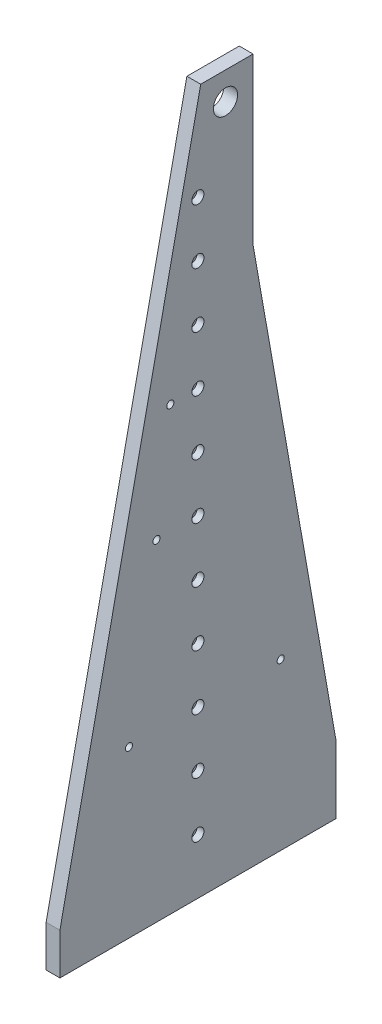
from build123d import *

# Parameters (mm, degrees)
BOSS_EXTRUDE1_DEPTH                              = 12.7
F_7_8_0_875_DIAMETER_HOLE1_D                     = 22.225
F_1_4_CLEARANCE_HOLE1_D                          = 6.5278
F_1_4_CLEARANCE_HOLE1_DEPTH                      = 22.86
F_1_4_CLEARANCE_HOLE1_TIP                        = 1.961148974
F_1_4_20_TAPPED_HOLE1_D                          = 5.1054
F_1_4_20_TAPPED_HOLE1_DEPTH                      = 13.335
F_1_4_20_TAPPED_HOLE1_TIP                        = 1.533816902
CBORE_FOR_1_4_SOCKET_HEAD_CAP_SCREW1_D           = 6.5278
CBORE_FOR_1_4_SOCKET_HEAD_CAP_SCREW1_CBORE_D     = 11.1125
CBORE_FOR_1_4_SOCKET_HEAD_CAP_SCREW1_CBORE_DEPTH = 6.35
LPATTERN1_COUNT                                  = 11
LPATTERN1_PITCH                                  = 50.8
FILLET1_R                                        = 9.652


with BuildPart() as part:
    # Sketch1 → Boss-Extrude1 (new body)
    with BuildSketch(Plane(origin=(0, 0, 0), x_dir=(0, 0, -1), z_dir=(1, 0, 0))):
        Polygon((2.574479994, 647.7), (50.8, 647.7), (50.8, 495.3), (127, 63.148325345), (127, 0), (-127, 0), (-127, 38.1), align=None)
    extrude(amount=BOSS_EXTRUDE1_DEPTH)

    # 7_8 _0.875_ Diameter Hole1 (through all)
    with Locations(Plane(origin=(12.7, 0, 0), x_dir=(0, 0, -1), z_dir=(1, 0, 0))):
        with Locations((25.4, 622.3)):
            Hole(F_7_8_0_875_DIAMETER_HOLE1_D / 2)

    # 1_4 Clearance Hole1
    with Locations(Plane(origin=(12.7, 0, 0), x_dir=(0, 0, -1), z_dir=(1, 0, 0))):
        with Locations((-25.4, 406.4), (-38.1, 304.8), (-63.5, 152.4), (76.2, 152.4)):
            Hole(F_1_4_CLEARANCE_HOLE1_D / 2, depth=F_1_4_CLEARANCE_HOLE1_DEPTH)
            with Locations((0, 0, -(F_1_4_CLEARANCE_HOLE1_DEPTH + F_1_4_CLEARANCE_HOLE1_TIP / 2))):  # 118° drill point
                Cone(0, F_1_4_CLEARANCE_HOLE1_D / 2, F_1_4_CLEARANCE_HOLE1_TIP, mode=Mode.SUBTRACT)

    # 1_4-20 Tapped Hole1
    with Locations(Plane(origin=(0, 0, 0), x_dir=(-1, 0, 0), z_dir=(0, -1, 0))):
        with Locations((-6.35, 101.6), (-6.35, 50.8), (-6.35, 0), (-6.35, -50.8), (-6.35, -101.6)):
            Hole(F_1_4_20_TAPPED_HOLE1_D / 2, depth=F_1_4_20_TAPPED_HOLE1_DEPTH)
            with Locations((0, 0, -(F_1_4_20_TAPPED_HOLE1_DEPTH + F_1_4_20_TAPPED_HOLE1_TIP / 2))):  # 118° drill point
                Cone(0, F_1_4_20_TAPPED_HOLE1_D / 2, F_1_4_20_TAPPED_HOLE1_TIP, mode=Mode.SUBTRACT)

    # CBORE for 1_4 Socket Head Cap Screw1 (through all)
    with Locations(Plane(origin=(12.7, 108.734321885, -10.380411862), x_dir=(0, 0, 1), z_dir=(1, 0, 0))):
        with Locations((10.380411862, 57.934321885)):
            cbore_for_1_4_socket_head_cap_screw1 = CounterBoreHole(CBORE_FOR_1_4_SOCKET_HEAD_CAP_SCREW1_D / 2, CBORE_FOR_1_4_SOCKET_HEAD_CAP_SCREW1_CBORE_D / 2, CBORE_FOR_1_4_SOCKET_HEAD_CAP_SCREW1_CBORE_DEPTH)

    # LPattern1: CBORE for 1_4 Socket Head Cap Screw1 ×11
    with Locations(*[(0, i * LPATTERN1_PITCH, 0) for i in range(1, LPATTERN1_COUNT)]):
        add(cbore_for_1_4_socket_head_cap_screw1, mode=Mode.SUBTRACT)

    # Fillet1
    fillet1_edges = [part.edges().sort_by_distance(p)[0] for p in [
        (6.35, 495.3, -50.8),
    ]]
    fillet(fillet1_edges, radius=FILLET1_R)


solid = part.part
